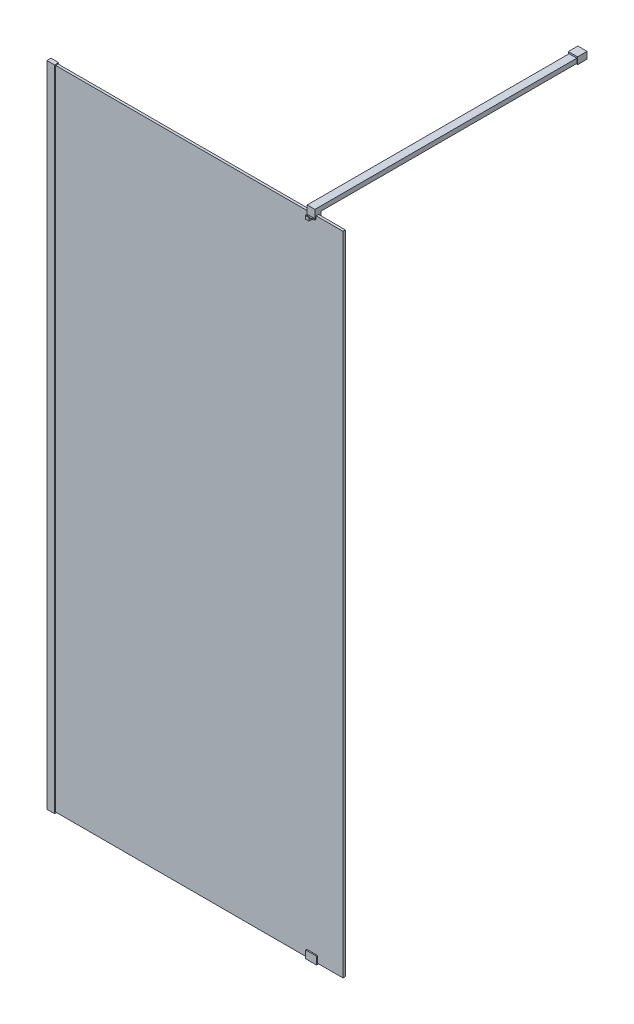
ISO-10303-21;
HEADER;
FILE_DESCRIPTION(('STEP AP214'),'2;1');
FILE_NAME('part.step','',(''),(''),'','','');
FILE_SCHEMA(('AUTOMOTIVE_DESIGN { 1 0 10303 214 1 1 1 1 }'));
ENDSEC;
DATA;
#1=APPLICATION_CONTEXT('core data for automotive mechanical design processes');
#2=APPLICATION_PROTOCOL_DEFINITION('international standard','automotive_design',2000,#1);
#3=PRODUCT_CONTEXT('',#1,'mechanical');
#4=PRODUCT('Part','Part','',(#3));
#5=PRODUCT_RELATED_PRODUCT_CATEGORY('part','',(#4));
#6=PRODUCT_DEFINITION_FORMATION('','',#4);
#7=PRODUCT_DEFINITION_CONTEXT('part definition',#1,'design');
#8=PRODUCT_DEFINITION('design','',#6,#7);
#9=PRODUCT_DEFINITION_SHAPE('','',#8);
#10=(LENGTH_UNIT() NAMED_UNIT(*) SI_UNIT(.MILLI.,.METRE.));
#11=(NAMED_UNIT(*) PLANE_ANGLE_UNIT() SI_UNIT($,.RADIAN.));
#12=(NAMED_UNIT(*) SI_UNIT($,.STERADIAN.) SOLID_ANGLE_UNIT());
#13=UNCERTAINTY_MEASURE_WITH_UNIT(LENGTH_MEASURE(1.E-05),#10,'distance_accuracy_value','');
#14=(GEOMETRIC_REPRESENTATION_CONTEXT(3) GLOBAL_UNCERTAINTY_ASSIGNED_CONTEXT((#13)) GLOBAL_UNIT_ASSIGNED_CONTEXT((#10,
#11,#12)) REPRESENTATION_CONTEXT('',''));
#15=CARTESIAN_POINT('',(0.,0.,0.));
#16=DIRECTION('',(0.,0.,1.));
#17=DIRECTION('',(1.,0.,0.));
#18=AXIS2_PLACEMENT_3D('',#15,#16,#17);
#19=CARTESIAN_POINT('',(870.95,2090.,-19.4000000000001));
#20=DIRECTION('',(-1.,0.,0.));
#21=DIRECTION('',(0.,0.,1.));
#22=AXIS2_PLACEMENT_3D('',#19,#20,#21);
#23=PLANE('',#22);
#24=DIRECTION('',(0.,-1.,0.));
#25=VECTOR('',#24,1.);
#26=CARTESIAN_POINT('',(870.95,2090.,-850.03));
#27=LINE('',#26,#25);
#28=CARTESIAN_POINT('',(870.95,2120.,-850.03));
#29=VERTEX_POINT('',#28);
#30=CARTESIAN_POINT('',(870.95,2105.,-850.03));
#31=VERTEX_POINT('',#30);
#32=EDGE_CURVE('E61',#29,#31,#27,.T.);
#33=ORIENTED_EDGE('',*,*,#32,.F.);
#34=DIRECTION('',(0.,0.,1.));
#35=VECTOR('',#34,1.);
#36=CARTESIAN_POINT('',(870.95,2120.,0.599999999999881));
#37=LINE('',#36,#35);
#38=CARTESIAN_POINT('',(870.95,2120.,0.599999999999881));
#39=VERTEX_POINT('',#38);
#40=EDGE_CURVE('E386',#29,#39,#37,.T.);
#41=ORIENTED_EDGE('',*,*,#40,.T.);
#42=DIRECTION('',(0.,-1.,0.));
#43=VECTOR('',#42,1.);
#44=CARTESIAN_POINT('',(870.95,2094.,0.599999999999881));
#45=LINE('',#44,#43);
#46=CARTESIAN_POINT('',(870.95,2094.,0.599999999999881));
#47=VERTEX_POINT('',#46);
#48=EDGE_CURVE('E388',#39,#47,#45,.T.);
#49=ORIENTED_EDGE('',*,*,#48,.T.);
#50=DIRECTION('',(0.,1.,0.));
#51=VECTOR('',#50,1.);
#52=CARTESIAN_POINT('',(870.95,2090.,0.599999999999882));
#53=LINE('',#52,#51);
#54=CARTESIAN_POINT('',(870.95,2090.,0.599999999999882));
#55=VERTEX_POINT('',#54);
#56=EDGE_CURVE('E332',#55,#47,#53,.T.);
#57=ORIENTED_EDGE('',*,*,#56,.F.);
#58=DIRECTION('',(0.,0.,-1.));
#59=VECTOR('',#58,1.);
#60=CARTESIAN_POINT('',(870.95,2090.,-3.40000000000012));
#61=LINE('',#60,#59);
#62=CARTESIAN_POINT('',(870.95,2090.,-3.40000000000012));
#63=VERTEX_POINT('',#62);
#64=EDGE_CURVE('E362',#55,#63,#61,.T.);
#65=ORIENTED_EDGE('',*,*,#64,.T.);
#66=DIRECTION('',(0.,1.,-1.30407837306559E-13));
#67=VECTOR('',#66,1.);
#68=CARTESIAN_POINT('',(870.95,2100.,-3.40000000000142));
#69=LINE('',#68,#67);
#70=CARTESIAN_POINT('',(870.95,2100.,-3.40000000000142));
#71=VERTEX_POINT('',#70);
#72=EDGE_CURVE('E392',#63,#71,#69,.T.);
#73=ORIENTED_EDGE('',*,*,#72,.T.);
#74=DIRECTION('',(0.,0.,-1.));
#75=VECTOR('',#74,1.);
#76=CARTESIAN_POINT('',(870.95,2100.,-11.4000000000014));
#77=LINE('',#76,#75);
#78=CARTESIAN_POINT('',(870.95,2100.,-11.4000000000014));
#79=VERTEX_POINT('',#78);
#80=EDGE_CURVE('E394',#71,#79,#77,.T.);
#81=ORIENTED_EDGE('',*,*,#80,.T.);
#82=DIRECTION('',(0.,-1.,1.30451205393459E-13));
#83=VECTOR('',#82,1.);
#84=CARTESIAN_POINT('',(870.95,2090.,-11.4000000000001));
#85=LINE('',#84,#83);
#86=CARTESIAN_POINT('',(870.95,2090.,-11.4000000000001));
#87=VERTEX_POINT('',#86);
#88=EDGE_CURVE('E395',#79,#87,#85,.T.);
#89=ORIENTED_EDGE('',*,*,#88,.T.);
#90=DIRECTION('',(0.,0.,-1.));
#91=VECTOR('',#90,1.);
#92=CARTESIAN_POINT('',(870.95,2090.,-19.4000000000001));
#93=LINE('',#92,#91);
#94=CARTESIAN_POINT('',(870.95,2090.,-19.4000000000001));
#95=VERTEX_POINT('',#94);
#96=EDGE_CURVE('E283',#87,#95,#93,.T.);
#97=ORIENTED_EDGE('',*,*,#96,.T.);
#98=DIRECTION('',(0.,1.,0.));
#99=VECTOR('',#98,1.);
#100=CARTESIAN_POINT('',(870.95,2120.,-19.4000000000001));
#101=LINE('',#100,#99);
#102=CARTESIAN_POINT('',(870.95,2105.,-19.4000000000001));
#103=VERTEX_POINT('',#102);
#104=EDGE_CURVE('E249',#95,#103,#101,.T.);
#105=ORIENTED_EDGE('',*,*,#104,.T.);
#106=DIRECTION('',(0.,0.,-1.));
#107=VECTOR('',#106,1.);
#108=CARTESIAN_POINT('',(870.95,2105.,-881.03));
#109=LINE('',#108,#107);
#110=EDGE_CURVE('E248',#103,#31,#109,.T.);
#111=ORIENTED_EDGE('',*,*,#110,.T.);
#112=EDGE_LOOP('',(#33,#41,#49,#57,#65,#73,#81,#89,#97,#105,#111));
#113=FACE_BOUND('',#112,.T.);
#114=ADVANCED_FACE('F46',(#113),#23,.F.);
#115=CARTESIAN_POINT('',(845.95,2090.,-19.4000000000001));
#116=DIRECTION('',(-1.,0.,0.));
#117=DIRECTION('',(0.,0.,1.));
#118=AXIS2_PLACEMENT_3D('',#115,#116,#117);
#119=PLANE('',#118);
#120=DIRECTION('',(0.,0.,1.));
#121=VECTOR('',#120,1.);
#122=CARTESIAN_POINT('',(845.95,2120.,0.599999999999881));
#123=LINE('',#122,#121);
#124=CARTESIAN_POINT('',(845.95,2120.,-850.03));
#125=VERTEX_POINT('',#124);
#126=CARTESIAN_POINT('',(845.95,2120.,0.599999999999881));
#127=VERTEX_POINT('',#126);
#128=EDGE_CURVE('E272',#125,#127,#123,.T.);
#129=ORIENTED_EDGE('',*,*,#128,.F.);
#130=DIRECTION('',(0.,-1.,0.));
#131=VECTOR('',#130,1.);
#132=CARTESIAN_POINT('',(845.95,2090.,-850.03));
#133=LINE('',#132,#131);
#134=CARTESIAN_POINT('',(845.95,2105.,-850.03));
#135=VERTEX_POINT('',#134);
#136=EDGE_CURVE('E230',#125,#135,#133,.T.);
#137=ORIENTED_EDGE('',*,*,#136,.T.);
#138=DIRECTION('',(0.,0.,1.));
#139=VECTOR('',#138,1.);
#140=CARTESIAN_POINT('',(845.95,2105.,-881.03));
#141=LINE('',#140,#139);
#142=CARTESIAN_POINT('',(845.95,2105.,-19.4000000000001));
#143=VERTEX_POINT('',#142);
#144=EDGE_CURVE('E238',#135,#143,#141,.T.);
#145=ORIENTED_EDGE('',*,*,#144,.T.);
#146=DIRECTION('',(0.,1.,0.));
#147=VECTOR('',#146,1.);
#148=CARTESIAN_POINT('',(845.95,2120.,-19.4000000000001));
#149=LINE('',#148,#147);
#150=CARTESIAN_POINT('',(845.95,2090.,-19.4000000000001));
#151=VERTEX_POINT('',#150);
#152=EDGE_CURVE('E262',#151,#143,#149,.T.);
#153=ORIENTED_EDGE('',*,*,#152,.F.);
#154=DIRECTION('',(0.,0.,-1.));
#155=VECTOR('',#154,1.);
#156=CARTESIAN_POINT('',(845.95,2090.,-19.4000000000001));
#157=LINE('',#156,#155);
#158=CARTESIAN_POINT('',(845.95,2090.,-11.4000000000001));
#159=VERTEX_POINT('',#158);
#160=EDGE_CURVE('E296',#159,#151,#157,.T.);
#161=ORIENTED_EDGE('',*,*,#160,.F.);
#162=DIRECTION('',(0.,-1.,1.30451205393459E-13));
#163=VECTOR('',#162,1.);
#164=CARTESIAN_POINT('',(845.95,2090.,-11.4000000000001));
#165=LINE('',#164,#163);
#166=CARTESIAN_POINT('',(845.95,2100.,-11.4000000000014));
#167=VERTEX_POINT('',#166);
#168=EDGE_CURVE('E294',#167,#159,#165,.T.);
#169=ORIENTED_EDGE('',*,*,#168,.F.);
#170=DIRECTION('',(0.,0.,-1.));
#171=VECTOR('',#170,1.);
#172=CARTESIAN_POINT('',(845.95,2100.,-11.4000000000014));
#173=LINE('',#172,#171);
#174=CARTESIAN_POINT('',(845.95,2100.,-3.40000000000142));
#175=VERTEX_POINT('',#174);
#176=EDGE_CURVE('E292',#175,#167,#173,.T.);
#177=ORIENTED_EDGE('',*,*,#176,.F.);
#178=DIRECTION('',(0.,1.,-1.30407837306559E-13));
#179=VECTOR('',#178,1.);
#180=CARTESIAN_POINT('',(845.95,2100.,-3.40000000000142));
#181=LINE('',#180,#179);
#182=CARTESIAN_POINT('',(845.95,2090.,-3.40000000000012));
#183=VERTEX_POINT('',#182);
#184=EDGE_CURVE('E290',#183,#175,#181,.T.);
#185=ORIENTED_EDGE('',*,*,#184,.F.);
#186=DIRECTION('',(0.,0.,-1.));
#187=VECTOR('',#186,1.);
#188=CARTESIAN_POINT('',(845.95,2090.,-3.40000000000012));
#189=LINE('',#188,#187);
#190=CARTESIAN_POINT('',(845.95,2090.,0.599999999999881));
#191=VERTEX_POINT('',#190);
#192=EDGE_CURVE('E288',#191,#183,#189,.T.);
#193=ORIENTED_EDGE('',*,*,#192,.F.);
#194=DIRECTION('',(0.,1.,0.));
#195=VECTOR('',#194,1.);
#196=CARTESIAN_POINT('',(845.95,2090.,0.599999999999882));
#197=LINE('',#196,#195);
#198=CARTESIAN_POINT('',(845.95,2094.,0.599999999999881));
#199=VERTEX_POINT('',#198);
#200=EDGE_CURVE('E329',#191,#199,#197,.T.);
#201=ORIENTED_EDGE('',*,*,#200,.T.);
#202=DIRECTION('',(0.,-1.,0.));
#203=VECTOR('',#202,1.);
#204=CARTESIAN_POINT('',(845.95,2094.,0.599999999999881));
#205=LINE('',#204,#203);
#206=EDGE_CURVE('E274',#127,#199,#205,.T.);
#207=ORIENTED_EDGE('',*,*,#206,.F.);
#208=EDGE_LOOP('',(#129,#137,#145,#153,#161,#169,#177,#185,#193,#201,#207));
#209=FACE_BOUND('',#208,.T.);
#210=ADVANCED_FACE('F259',(#209),#119,.T.);
#211=CARTESIAN_POINT('',(870.95,2120.,0.599999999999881));
#212=DIRECTION('',(0.,-1.,0.));
#213=DIRECTION('',(0.,0.,-1.));
#214=AXIS2_PLACEMENT_3D('',#211,#212,#213);
#215=PLANE('',#214);
#216=DIRECTION('',(1.,0.,0.));
#217=VECTOR('',#216,1.);
#218=CARTESIAN_POINT('',(870.95,2120.,-850.03));
#219=LINE('',#218,#217);
#220=EDGE_CURVE('E68',#125,#29,#219,.T.);
#221=ORIENTED_EDGE('',*,*,#220,.F.);
#222=ORIENTED_EDGE('',*,*,#128,.T.);
#223=DIRECTION('',(-1.,0.,0.));
#224=VECTOR('',#223,1.);
#225=CARTESIAN_POINT('',(870.95,2120.,0.599999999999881));
#226=LINE('',#225,#224);
#227=EDGE_CURVE('E326',#39,#127,#226,.T.);
#228=ORIENTED_EDGE('',*,*,#227,.F.);
#229=ORIENTED_EDGE('',*,*,#40,.F.);
#230=EDGE_LOOP('',(#221,#222,#228,#229));
#231=FACE_BOUND('',#230,.T.);
#232=ADVANCED_FACE('F437',(#231),#215,.F.);
#233=CARTESIAN_POINT('',(845.95,2105.,-19.4000000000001));
#234=DIRECTION('',(0.,1.,0.));
#235=DIRECTION('',(0.,0.,1.));
#236=AXIS2_PLACEMENT_3D('',#233,#234,#235);
#237=PLANE('',#236);
#238=DIRECTION('',(-1.,0.,0.));
#239=VECTOR('',#238,1.);
#240=CARTESIAN_POINT('',(845.95,2105.,-850.03));
#241=LINE('',#240,#239);
#242=EDGE_CURVE('E12',#31,#135,#241,.T.);
#243=ORIENTED_EDGE('',*,*,#242,.F.);
#244=ORIENTED_EDGE('',*,*,#110,.F.);
#245=DIRECTION('',(1.,0.,0.));
#246=VECTOR('',#245,1.);
#247=CARTESIAN_POINT('',(845.95,2105.,-19.4000000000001));
#248=LINE('',#247,#246);
#249=EDGE_CURVE('E244',#143,#103,#248,.T.);
#250=ORIENTED_EDGE('',*,*,#249,.F.);
#251=ORIENTED_EDGE('',*,*,#144,.F.);
#252=EDGE_LOOP('',(#243,#244,#250,#251));
#253=FACE_BOUND('',#252,.T.);
#254=ADVANCED_FACE('F265',(#253),#237,.F.);
#255=CARTESIAN_POINT('',(870.95,2094.,9.84506801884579));
#256=DIRECTION('',(0.,-1.,0.));
#257=DIRECTION('',(0.,0.,-1.));
#258=AXIS2_PLACEMENT_3D('',#255,#256,#257);
#259=PLANE('',#258);
#260=DIRECTION('',(-0.906307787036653,0.,-0.422618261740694));
#261=VECTOR('',#260,1.);
#262=CARTESIAN_POINT('',(870.025911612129,2094.,11.8267819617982));
#263=LINE('',#262,#261);
#264=CARTESIAN_POINT('',(852.45,2094.,3.6309997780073));
#265=VERTEX_POINT('',#264);
#266=EDGE_CURVE('E365',#265,#199,#263,.T.);
#267=ORIENTED_EDGE('',*,*,#266,.F.);
#268=DIRECTION('',(0.,0.,-1.));
#269=VECTOR('',#268,1.);
#270=CARTESIAN_POINT('',(852.45,2094.,9.84506801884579));
#271=LINE('',#270,#269);
#272=CARTESIAN_POINT('',(852.45,2094.,9.84506801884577));
#273=VERTEX_POINT('',#272);
#274=EDGE_CURVE('E273',#273,#265,#271,.T.);
#275=ORIENTED_EDGE('',*,*,#274,.F.);
#276=DIRECTION('',(-1.,0.,0.));
#277=VECTOR('',#276,1.);
#278=CARTESIAN_POINT('',(870.95,2094.,9.84506801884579));
#279=LINE('',#278,#277);
#280=CARTESIAN_POINT('',(864.45,2094.,9.84506801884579));
#281=VERTEX_POINT('',#280);
#282=EDGE_CURVE('E320',#281,#273,#279,.T.);
#283=ORIENTED_EDGE('',*,*,#282,.F.);
#284=DIRECTION('',(0.,0.,1.));
#285=VECTOR('',#284,1.);
#286=CARTESIAN_POINT('',(864.45,2094.,9.84506801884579));
#287=LINE('',#286,#285);
#288=CARTESIAN_POINT('',(864.45,2094.,3.63099977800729));
#289=VERTEX_POINT('',#288);
#290=EDGE_CURVE('E379',#289,#281,#287,.T.);
#291=ORIENTED_EDGE('',*,*,#290,.F.);
#292=DIRECTION('',(-0.906307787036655,0.,0.422618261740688));
#293=VECTOR('',#292,1.);
#294=CARTESIAN_POINT('',(867.408933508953,2094.,2.25122642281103));
#295=LINE('',#294,#293);
#296=EDGE_CURVE('E364',#47,#289,#295,.T.);
#297=ORIENTED_EDGE('',*,*,#296,.F.);
#298=DIRECTION('',(-1.,0.,0.));
#299=VECTOR('',#298,1.);
#300=CARTESIAN_POINT('',(870.95,2094.,0.599999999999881));
#301=LINE('',#300,#299);
#302=EDGE_CURVE('E323',#47,#199,#301,.T.);
#303=ORIENTED_EDGE('',*,*,#302,.T.);
#304=EDGE_LOOP('',(#267,#275,#283,#291,#297,#303));
#305=FACE_BOUND('',#304,.T.);
#306=ADVANCED_FACE('F424',(#305),#259,.F.);
#307=CARTESIAN_POINT('',(870.95,2100.,10.3700000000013));
#308=DIRECTION('',(0.,-0.087155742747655,0.996194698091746));
#309=DIRECTION('',(0.,-0.996194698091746,-0.087155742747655));
#310=AXIS2_PLACEMENT_3D('',#307,#308,#309);
#311=PLANE('',#310);
#312=DIRECTION('',(0.,-0.996194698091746,-0.087155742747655));
#313=VECTOR('',#312,1.);
#314=CARTESIAN_POINT('',(852.45,2100.,10.3700000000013));
#315=LINE('',#314,#313);
#316=CARTESIAN_POINT('',(852.45,2100.,10.3700000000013));
#317=VERTEX_POINT('',#316);
#318=EDGE_CURVE('E276',#317,#273,#315,.T.);
#319=ORIENTED_EDGE('',*,*,#318,.F.);
#320=DIRECTION('',(-1.,0.,0.));
#321=VECTOR('',#320,1.);
#322=CARTESIAN_POINT('',(870.95,2100.,10.3700000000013));
#323=LINE('',#322,#321);
#324=CARTESIAN_POINT('',(864.45,2100.,10.3700000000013));
#325=VERTEX_POINT('',#324);
#326=EDGE_CURVE('E317',#325,#317,#323,.T.);
#327=ORIENTED_EDGE('',*,*,#326,.F.);
#328=DIRECTION('',(0.,0.996194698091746,0.087155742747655));
#329=VECTOR('',#328,1.);
#330=CARTESIAN_POINT('',(864.45,2100.,10.3700000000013));
#331=LINE('',#330,#329);
#332=EDGE_CURVE('E376',#281,#325,#331,.T.);
#333=ORIENTED_EDGE('',*,*,#332,.F.);
#334=ORIENTED_EDGE('',*,*,#282,.T.);
#335=EDGE_LOOP('',(#319,#327,#333,#334));
#336=FACE_BOUND('',#335,.T.);
#337=ADVANCED_FACE('F428',(#336),#311,.F.);
#338=CARTESIAN_POINT('',(870.95,2100.,13.3700000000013));
#339=DIRECTION('',(0.,-1.,1.48029736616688E-13));
#340=DIRECTION('',(0.,-1.48029736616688E-13,-1.));
#341=AXIS2_PLACEMENT_3D('',#338,#339,#340);
#342=PLANE('',#341);
#343=DIRECTION('',(0.,-1.48029736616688E-13,-1.));
#344=VECTOR('',#343,1.);
#345=CARTESIAN_POINT('',(852.45,2100.,13.3700000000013));
#346=LINE('',#345,#344);
#347=CARTESIAN_POINT('',(852.45,2100.,13.3700000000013));
#348=VERTEX_POINT('',#347);
#349=EDGE_CURVE('E382',#348,#317,#346,.T.);
#350=ORIENTED_EDGE('',*,*,#349,.F.);
#351=DIRECTION('',(-1.,0.,0.));
#352=VECTOR('',#351,1.);
#353=CARTESIAN_POINT('',(870.95,2100.,13.3700000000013));
#354=LINE('',#353,#352);
#355=CARTESIAN_POINT('',(864.45,2100.,13.3700000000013));
#356=VERTEX_POINT('',#355);
#357=EDGE_CURVE('E314',#356,#348,#354,.T.);
#358=ORIENTED_EDGE('',*,*,#357,.F.);
#359=DIRECTION('',(0.,1.48029736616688E-13,1.));
#360=VECTOR('',#359,1.);
#361=CARTESIAN_POINT('',(864.45,2100.,13.3700000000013));
#362=LINE('',#361,#360);
#363=EDGE_CURVE('E368',#325,#356,#362,.T.);
#364=ORIENTED_EDGE('',*,*,#363,.F.);
#365=ORIENTED_EDGE('',*,*,#326,.T.);
#366=EDGE_LOOP('',(#350,#358,#364,#365));
#367=FACE_BOUND('',#366,.T.);
#368=ADVANCED_FACE('F431',(#367),#342,.F.);
#369=CARTESIAN_POINT('',(870.95,2090.,13.3700000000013));
#370=DIRECTION('',(0.,0.,-1.));
#371=DIRECTION('',(0.,1.,0.));
#372=AXIS2_PLACEMENT_3D('',#369,#370,#371);
#373=PLANE('',#372);
#374=ORIENTED_EDGE('',*,*,#357,.T.);
#375=DIRECTION('',(0.,-1.,0.));
#376=VECTOR('',#375,1.);
#377=CARTESIAN_POINT('',(852.45,7640.69449514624,13.3700000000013));
#378=LINE('',#377,#376);
#379=CARTESIAN_POINT('',(852.45,2090.,13.3700000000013));
#380=VERTEX_POINT('',#379);
#381=EDGE_CURVE('E345',#348,#380,#378,.T.);
#382=ORIENTED_EDGE('',*,*,#381,.T.);
#383=DIRECTION('',(-1.,0.,0.));
#384=VECTOR('',#383,1.);
#385=CARTESIAN_POINT('',(870.95,2090.,13.3700000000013));
#386=LINE('',#385,#384);
#387=CARTESIAN_POINT('',(864.45,2090.,13.3700000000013));
#388=VERTEX_POINT('',#387);
#389=EDGE_CURVE('E311',#388,#380,#386,.T.);
#390=ORIENTED_EDGE('',*,*,#389,.F.);
#391=DIRECTION('',(0.,-1.,0.));
#392=VECTOR('',#391,1.);
#393=CARTESIAN_POINT('',(864.45,7640.69449514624,13.3700000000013));
#394=LINE('',#393,#392);
#395=EDGE_CURVE('E355',#356,#388,#394,.T.);
#396=ORIENTED_EDGE('',*,*,#395,.F.);
#397=EDGE_LOOP('',(#374,#382,#390,#396));
#398=FACE_BOUND('',#397,.T.);
#399=ADVANCED_FACE('F353',(#398),#373,.F.);
#400=CARTESIAN_POINT('',(870.95,2090.,-3.40000000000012));
#401=DIRECTION('',(0.,1.,0.));
#402=DIRECTION('',(0.,0.,1.));
#403=AXIS2_PLACEMENT_3D('',#400,#401,#402);
#404=PLANE('',#403);
#405=DIRECTION('',(0.906307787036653,0.,0.422618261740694));
#406=VECTOR('',#405,1.);
#407=CARTESIAN_POINT('',(864.952756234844,2090.,9.46113075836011));
#408=LINE('',#407,#406);
#409=CARTESIAN_POINT('',(852.45,2090.,3.6309997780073));
#410=VERTEX_POINT('',#409);
#411=EDGE_CURVE('E370',#191,#410,#408,.T.);
#412=ORIENTED_EDGE('',*,*,#411,.F.);
#413=ORIENTED_EDGE('',*,*,#192,.T.);
#414=DIRECTION('',(-1.,0.,0.));
#415=VECTOR('',#414,1.);
#416=CARTESIAN_POINT('',(870.95,2090.,-3.40000000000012));
#417=LINE('',#416,#415);
#418=EDGE_CURVE('E308',#63,#183,#417,.T.);
#419=ORIENTED_EDGE('',*,*,#418,.F.);
#420=ORIENTED_EDGE('',*,*,#64,.F.);
#421=DIRECTION('',(0.906307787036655,0.,-0.422618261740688));
#422=VECTOR('',#421,1.);
#423=CARTESIAN_POINT('',(872.482088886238,2090.,-0.114424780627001));
#424=LINE('',#423,#422);
#425=CARTESIAN_POINT('',(864.45,2090.,3.6309997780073));
#426=VERTEX_POINT('',#425);
#427=EDGE_CURVE('E360',#426,#55,#424,.T.);
#428=ORIENTED_EDGE('',*,*,#427,.F.);
#429=DIRECTION('',(0.,0.,-1.));
#430=VECTOR('',#429,1.);
#431=CARTESIAN_POINT('',(864.45,2090.,-3.40000000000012));
#432=LINE('',#431,#430);
#433=EDGE_CURVE('E334',#388,#426,#432,.T.);
#434=ORIENTED_EDGE('',*,*,#433,.F.);
#435=ORIENTED_EDGE('',*,*,#389,.T.);
#436=DIRECTION('',(0.,0.,1.));
#437=VECTOR('',#436,1.);
#438=CARTESIAN_POINT('',(852.45,2090.,-3.40000000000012));
#439=LINE('',#438,#437);
#440=EDGE_CURVE('E54',#410,#380,#439,.T.);
#441=ORIENTED_EDGE('',*,*,#440,.F.);
#442=EDGE_LOOP('',(#412,#413,#419,#420,#428,#434,#435,#441));
#443=FACE_BOUND('',#442,.T.);
#444=ADVANCED_FACE('F357',(#443),#404,.F.);
#445=CARTESIAN_POINT('',(870.95,2120.,-19.4000000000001));
#446=DIRECTION('',(0.,0.,1.));
#447=DIRECTION('',(0.,-1.,0.));
#448=AXIS2_PLACEMENT_3D('',#445,#446,#447);
#449=PLANE('',#448);
#450=ORIENTED_EDGE('',*,*,#152,.T.);
#451=ORIENTED_EDGE('',*,*,#249,.T.);
#452=ORIENTED_EDGE('',*,*,#104,.F.);
#453=DIRECTION('',(-1.,0.,0.));
#454=VECTOR('',#453,1.);
#455=CARTESIAN_POINT('',(870.95,2090.,-19.4000000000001));
#456=LINE('',#455,#454);
#457=EDGE_CURVE('E271',#95,#151,#456,.T.);
#458=ORIENTED_EDGE('',*,*,#457,.T.);
#459=EDGE_LOOP('',(#450,#451,#452,#458));
#460=FACE_BOUND('',#459,.T.);
#461=ADVANCED_FACE('F48',(#460),#449,.F.);
#462=CARTESIAN_POINT('',(870.95,2094.,0.599999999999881));
#463=DIRECTION('',(0.,0.,-1.));
#464=DIRECTION('',(0.,1.,0.));
#465=AXIS2_PLACEMENT_3D('',#462,#463,#464);
#466=PLANE('',#465);
#467=ORIENTED_EDGE('',*,*,#206,.T.);
#468=ORIENTED_EDGE('',*,*,#302,.F.);
#469=ORIENTED_EDGE('',*,*,#48,.F.);
#470=ORIENTED_EDGE('',*,*,#227,.T.);
#471=EDGE_LOOP('',(#467,#468,#469,#470));
#472=FACE_BOUND('',#471,.T.);
#473=ADVANCED_FACE('F435',(#472),#466,.F.);
#474=CARTESIAN_POINT('',(870.95,2100.,-3.40000000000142));
#475=DIRECTION('',(0.,1.30407837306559E-13,1.));
#476=DIRECTION('',(0.,-1.,1.30407837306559E-13));
#477=AXIS2_PLACEMENT_3D('',#474,#475,#476);
#478=PLANE('',#477);
#479=ORIENTED_EDGE('',*,*,#184,.T.);
#480=DIRECTION('',(-1.,0.,0.));
#481=VECTOR('',#480,1.);
#482=CARTESIAN_POINT('',(870.95,2100.,-3.40000000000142));
#483=LINE('',#482,#481);
#484=EDGE_CURVE('E305',#71,#175,#483,.T.);
#485=ORIENTED_EDGE('',*,*,#484,.F.);
#486=ORIENTED_EDGE('',*,*,#72,.F.);
#487=ORIENTED_EDGE('',*,*,#418,.T.);
#488=EDGE_LOOP('',(#479,#485,#486,#487));
#489=FACE_BOUND('',#488,.T.);
#490=ADVANCED_FACE('F413',(#489),#478,.F.);
#491=CARTESIAN_POINT('',(870.95,2100.,-11.4000000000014));
#492=DIRECTION('',(0.,1.,0.));
#493=DIRECTION('',(0.,0.,1.));
#494=AXIS2_PLACEMENT_3D('',#491,#492,#493);
#495=PLANE('',#494);
#496=ORIENTED_EDGE('',*,*,#176,.T.);
#497=DIRECTION('',(-1.,0.,0.));
#498=VECTOR('',#497,1.);
#499=CARTESIAN_POINT('',(870.95,2100.,-11.4000000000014));
#500=LINE('',#499,#498);
#501=EDGE_CURVE('E302',#79,#167,#500,.T.);
#502=ORIENTED_EDGE('',*,*,#501,.F.);
#503=ORIENTED_EDGE('',*,*,#80,.F.);
#504=ORIENTED_EDGE('',*,*,#484,.T.);
#505=EDGE_LOOP('',(#496,#502,#503,#504));
#506=FACE_BOUND('',#505,.T.);
#507=ADVANCED_FACE('F409',(#506),#495,.F.);
#508=CARTESIAN_POINT('',(870.95,2090.,-11.4000000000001));
#509=DIRECTION('',(0.,-1.30451205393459E-13,-1.));
#510=DIRECTION('',(0.,1.,-1.30451205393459E-13));
#511=AXIS2_PLACEMENT_3D('',#508,#509,#510);
#512=PLANE('',#511);
#513=ORIENTED_EDGE('',*,*,#168,.T.);
#514=DIRECTION('',(-1.,0.,0.));
#515=VECTOR('',#514,1.);
#516=CARTESIAN_POINT('',(870.95,2090.,-11.4000000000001));
#517=LINE('',#516,#515);
#518=EDGE_CURVE('E299',#87,#159,#517,.T.);
#519=ORIENTED_EDGE('',*,*,#518,.F.);
#520=ORIENTED_EDGE('',*,*,#88,.F.);
#521=ORIENTED_EDGE('',*,*,#501,.T.);
#522=EDGE_LOOP('',(#513,#519,#520,#521));
#523=FACE_BOUND('',#522,.T.);
#524=ADVANCED_FACE('F405',(#523),#512,.F.);
#525=CARTESIAN_POINT('',(870.95,2090.,-19.4000000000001));
#526=DIRECTION('',(0.,1.,0.));
#527=DIRECTION('',(0.,0.,1.));
#528=AXIS2_PLACEMENT_3D('',#525,#526,#527);
#529=PLANE('',#528);
#530=ORIENTED_EDGE('',*,*,#160,.T.);
#531=ORIENTED_EDGE('',*,*,#457,.F.);
#532=ORIENTED_EDGE('',*,*,#96,.F.);
#533=ORIENTED_EDGE('',*,*,#518,.T.);
#534=EDGE_LOOP('',(#530,#531,#532,#533));
#535=FACE_BOUND('',#534,.T.);
#536=ADVANCED_FACE('F400',(#535),#529,.F.);
#537=CARTESIAN_POINT('',(845.95,7640.69449514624,0.599999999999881));
#538=DIRECTION('',(-0.422618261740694,0.,0.906307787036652));
#539=DIRECTION('',(0.906307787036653,0.,0.422618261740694));
#540=AXIS2_PLACEMENT_3D('',#537,#538,#539);
#541=PLANE('',#540);
#542=DIRECTION('',(0.,-1.,0.));
#543=VECTOR('',#542,1.);
#544=CARTESIAN_POINT('',(852.45,7640.69449514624,3.6309997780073));
#545=LINE('',#544,#543);
#546=EDGE_CURVE('E348',#265,#410,#545,.T.);
#547=ORIENTED_EDGE('',*,*,#546,.F.);
#548=ORIENTED_EDGE('',*,*,#266,.T.);
#549=ORIENTED_EDGE('',*,*,#200,.F.);
#550=ORIENTED_EDGE('',*,*,#411,.T.);
#551=EDGE_LOOP('',(#547,#548,#549,#550));
#552=FACE_BOUND('',#551,.T.);
#553=ADVANCED_FACE('F432',(#552),#541,.T.);
#554=CARTESIAN_POINT('',(852.45,7640.69449514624,3.6309997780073));
#555=DIRECTION('',(-1.,0.,0.));
#556=DIRECTION('',(0.,0.,1.));
#557=AXIS2_PLACEMENT_3D('',#554,#555,#556);
#558=PLANE('',#557);
#559=ORIENTED_EDGE('',*,*,#318,.T.);
#560=ORIENTED_EDGE('',*,*,#274,.T.);
#561=ORIENTED_EDGE('',*,*,#546,.T.);
#562=ORIENTED_EDGE('',*,*,#440,.T.);
#563=ORIENTED_EDGE('',*,*,#381,.F.);
#564=ORIENTED_EDGE('',*,*,#349,.T.);
#565=EDGE_LOOP('',(#559,#560,#561,#562,#563,#564));
#566=FACE_BOUND('',#565,.T.);
#567=ADVANCED_FACE('F344',(#566),#558,.T.);
#568=CARTESIAN_POINT('',(864.45,7640.69449514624,3.6309997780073));
#569=DIRECTION('',(1.,0.,0.));
#570=DIRECTION('',(0.,0.,-1.));
#571=AXIS2_PLACEMENT_3D('',#568,#569,#570);
#572=PLANE('',#571);
#573=DIRECTION('',(0.,-1.,0.));
#574=VECTOR('',#573,1.);
#575=CARTESIAN_POINT('',(864.45,7640.69449514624,3.6309997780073));
#576=LINE('',#575,#574);
#577=EDGE_CURVE('E241',#289,#426,#576,.T.);
#578=ORIENTED_EDGE('',*,*,#577,.F.);
#579=ORIENTED_EDGE('',*,*,#290,.T.);
#580=ORIENTED_EDGE('',*,*,#332,.T.);
#581=ORIENTED_EDGE('',*,*,#363,.T.);
#582=ORIENTED_EDGE('',*,*,#395,.T.);
#583=ORIENTED_EDGE('',*,*,#433,.T.);
#584=EDGE_LOOP('',(#578,#579,#580,#581,#582,#583));
#585=FACE_BOUND('',#584,.T.);
#586=ADVANCED_FACE('F420',(#585),#572,.T.);
#587=CARTESIAN_POINT('',(870.95,7640.69449514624,0.599999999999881));
#588=DIRECTION('',(0.422618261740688,0.,0.906307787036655));
#589=DIRECTION('',(0.906307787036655,0.,-0.422618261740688));
#590=AXIS2_PLACEMENT_3D('',#587,#588,#589);
#591=PLANE('',#590);
#592=ORIENTED_EDGE('',*,*,#56,.T.);
#593=ORIENTED_EDGE('',*,*,#296,.T.);
#594=ORIENTED_EDGE('',*,*,#577,.T.);
#595=ORIENTED_EDGE('',*,*,#427,.T.);
#596=EDGE_LOOP('',(#592,#593,#594,#595));
#597=FACE_BOUND('',#596,.T.);
#598=ADVANCED_FACE('F418',(#597),#591,.T.);
#599=CARTESIAN_POINT('',(843.449999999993,2103.,-850.03));
#600=DIRECTION('',(0.,0.,-1.));
#601=DIRECTION('',(-1.,0.,0.));
#602=AXIS2_PLACEMENT_3D('',#599,#600,#601);
#603=PLANE('',#602);
#604=DIRECTION('',(0.,1.,0.));
#605=VECTOR('',#604,1.);
#606=CARTESIAN_POINT('',(843.449999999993,2125.,-850.03));
#607=LINE('',#606,#605);
#608=CARTESIAN_POINT('',(843.449999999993,2103.,-850.03));
#609=VERTEX_POINT('',#608);
#610=CARTESIAN_POINT('',(843.449999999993,2125.,-850.03));
#611=VERTEX_POINT('',#610);
#612=EDGE_CURVE('E209',#609,#611,#607,.T.);
#613=ORIENTED_EDGE('',*,*,#612,.F.);
#614=DIRECTION('',(-1.,0.,0.));
#615=VECTOR('',#614,1.);
#616=CARTESIAN_POINT('',(873.449999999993,2103.,-850.03));
#617=LINE('',#616,#615);
#618=CARTESIAN_POINT('',(873.449999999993,2103.,-850.03));
#619=VERTEX_POINT('',#618);
#620=EDGE_CURVE('E201',#619,#609,#617,.T.);
#621=ORIENTED_EDGE('',*,*,#620,.F.);
#622=DIRECTION('',(0.,-1.,0.));
#623=VECTOR('',#622,1.);
#624=CARTESIAN_POINT('',(873.449999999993,2125.,-850.03));
#625=LINE('',#624,#623);
#626=CARTESIAN_POINT('',(873.449999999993,2125.,-850.03));
#627=VERTEX_POINT('',#626);
#628=EDGE_CURVE('E212',#627,#619,#625,.T.);
#629=ORIENTED_EDGE('',*,*,#628,.F.);
#630=DIRECTION('',(1.,0.,0.));
#631=VECTOR('',#630,1.);
#632=CARTESIAN_POINT('',(873.449999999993,2125.,-850.03));
#633=LINE('',#632,#631);
#634=EDGE_CURVE('E193',#611,#627,#633,.T.);
#635=ORIENTED_EDGE('',*,*,#634,.F.);
#636=EDGE_LOOP('',(#613,#621,#629,#635));
#637=FACE_BOUND('',#636,.T.);
#638=ORIENTED_EDGE('',*,*,#136,.F.);
#639=ORIENTED_EDGE('',*,*,#220,.T.);
#640=ORIENTED_EDGE('',*,*,#32,.T.);
#641=ORIENTED_EDGE('',*,*,#242,.T.);
#642=EDGE_LOOP('',(#638,#639,#640,#641));
#643=FACE_BOUND('',#642,.T.);
#644=ADVANCED_FACE('F206',(#637,#643),#603,.F.);
#645=CARTESIAN_POINT('',(843.449999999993,2125.,-850.03));
#646=DIRECTION('',(-1.,0.,0.));
#647=DIRECTION('',(0.,-1.,0.));
#648=AXIS2_PLACEMENT_3D('',#645,#646,#647);
#649=PLANE('',#648);
#650=DIRECTION('',(0.,1.,0.));
#651=VECTOR('',#650,1.);
#652=CARTESIAN_POINT('',(843.449999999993,2125.,-881.03));
#653=LINE('',#652,#651);
#654=CARTESIAN_POINT('',(843.449999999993,2103.,-881.03));
#655=VERTEX_POINT('',#654);
#656=CARTESIAN_POINT('',(843.449999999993,2125.,-881.03));
#657=VERTEX_POINT('',#656);
#658=EDGE_CURVE('E224',#655,#657,#653,.T.);
#659=ORIENTED_EDGE('',*,*,#658,.F.);
#660=DIRECTION('',(0.,0.,-1.));
#661=VECTOR('',#660,1.);
#662=CARTESIAN_POINT('',(843.449999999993,2103.,-850.03));
#663=LINE('',#662,#661);
#664=EDGE_CURVE('E215',#609,#655,#663,.T.);
#665=ORIENTED_EDGE('',*,*,#664,.F.);
#666=ORIENTED_EDGE('',*,*,#612,.T.);
#667=DIRECTION('',(0.,0.,-1.));
#668=VECTOR('',#667,1.);
#669=CARTESIAN_POINT('',(843.449999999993,2125.,-850.03));
#670=LINE('',#669,#668);
#671=EDGE_CURVE('E190',#611,#657,#670,.T.);
#672=ORIENTED_EDGE('',*,*,#671,.T.);
#673=EDGE_LOOP('',(#659,#665,#666,#672));
#674=FACE_BOUND('',#673,.T.);
#675=ADVANCED_FACE('F214',(#674),#649,.T.);
#676=CARTESIAN_POINT('',(873.449999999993,2103.,-850.03));
#677=DIRECTION('',(0.,-1.,0.));
#678=DIRECTION('',(0.,0.,-1.));
#679=AXIS2_PLACEMENT_3D('',#676,#677,#678);
#680=PLANE('',#679);
#681=DIRECTION('',(-1.,0.,0.));
#682=VECTOR('',#681,1.);
#683=CARTESIAN_POINT('',(873.449999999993,2103.,-881.03));
#684=LINE('',#683,#682);
#685=CARTESIAN_POINT('',(873.449999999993,2103.,-881.03));
#686=VERTEX_POINT('',#685);
#687=EDGE_CURVE('E216',#686,#655,#684,.T.);
#688=ORIENTED_EDGE('',*,*,#687,.F.);
#689=DIRECTION('',(0.,0.,-1.));
#690=VECTOR('',#689,1.);
#691=CARTESIAN_POINT('',(873.449999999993,2103.,-850.03));
#692=LINE('',#691,#690);
#693=EDGE_CURVE('E231',#619,#686,#692,.T.);
#694=ORIENTED_EDGE('',*,*,#693,.F.);
#695=ORIENTED_EDGE('',*,*,#620,.T.);
#696=ORIENTED_EDGE('',*,*,#664,.T.);
#697=EDGE_LOOP('',(#688,#694,#695,#696));
#698=FACE_BOUND('',#697,.T.);
#699=ADVANCED_FACE('F444',(#698),#680,.T.);
#700=CARTESIAN_POINT('',(873.449999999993,2125.,-850.03));
#701=DIRECTION('',(1.,0.,0.));
#702=DIRECTION('',(0.,0.,-1.));
#703=AXIS2_PLACEMENT_3D('',#700,#701,#702);
#704=PLANE('',#703);
#705=DIRECTION('',(0.,-1.,0.));
#706=VECTOR('',#705,1.);
#707=CARTESIAN_POINT('',(873.449999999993,2125.,-881.03));
#708=LINE('',#707,#706);
#709=CARTESIAN_POINT('',(873.449999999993,2125.,-881.03));
#710=VERTEX_POINT('',#709);
#711=EDGE_CURVE('E219',#710,#686,#708,.T.);
#712=ORIENTED_EDGE('',*,*,#711,.F.);
#713=DIRECTION('',(0.,0.,-1.));
#714=VECTOR('',#713,1.);
#715=CARTESIAN_POINT('',(873.449999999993,2125.,-850.03));
#716=LINE('',#715,#714);
#717=EDGE_CURVE('E200',#627,#710,#716,.T.);
#718=ORIENTED_EDGE('',*,*,#717,.F.);
#719=ORIENTED_EDGE('',*,*,#628,.T.);
#720=ORIENTED_EDGE('',*,*,#693,.T.);
#721=EDGE_LOOP('',(#712,#718,#719,#720));
#722=FACE_BOUND('',#721,.T.);
#723=ADVANCED_FACE('F612',(#722),#704,.T.);
#724=CARTESIAN_POINT('',(873.449999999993,2125.,-850.03));
#725=DIRECTION('',(0.,1.,0.));
#726=DIRECTION('',(0.,0.,1.));
#727=AXIS2_PLACEMENT_3D('',#724,#725,#726);
#728=PLANE('',#727);
#729=DIRECTION('',(1.,0.,0.));
#730=VECTOR('',#729,1.);
#731=CARTESIAN_POINT('',(873.449999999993,2125.,-881.03));
#732=LINE('',#731,#730);
#733=EDGE_CURVE('E195',#657,#710,#732,.T.);
#734=ORIENTED_EDGE('',*,*,#733,.F.);
#735=ORIENTED_EDGE('',*,*,#671,.F.);
#736=ORIENTED_EDGE('',*,*,#634,.T.);
#737=ORIENTED_EDGE('',*,*,#717,.T.);
#738=EDGE_LOOP('',(#734,#735,#736,#737));
#739=FACE_BOUND('',#738,.T.);
#740=ADVANCED_FACE('F192',(#739),#728,.T.);
#741=CARTESIAN_POINT('',(845.95,2105.,-881.03));
#742=DIRECTION('',(0.,0.,-1.));
#743=DIRECTION('',(-1.,0.,0.));
#744=AXIS2_PLACEMENT_3D('',#741,#742,#743);
#745=PLANE('',#744);
#746=ORIENTED_EDGE('',*,*,#658,.T.);
#747=ORIENTED_EDGE('',*,*,#733,.T.);
#748=ORIENTED_EDGE('',*,*,#711,.T.);
#749=ORIENTED_EDGE('',*,*,#687,.T.);
#750=EDGE_LOOP('',(#746,#747,#748,#749));
#751=FACE_BOUND('',#750,.T.);
#752=ADVANCED_FACE('F485',(#751),#745,.T.);
#753=CLOSED_SHELL('',(#114,#210,#232,#254,#306,#337,#368,#399,#444,#461,#473,#490,#507,#524,
#536,#553,#567,#586,#598,#644,#675,#699,#723,#740,#752));
#754=MANIFOLD_SOLID_BREP('B2',#753);
#755=CARTESIAN_POINT('',(875.95,22.,-11.4000000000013));
#756=DIRECTION('',(0.,0.,-1.));
#757=DIRECTION('',(0.,1.,0.));
#758=AXIS2_PLACEMENT_3D('',#755,#756,#757);
#759=PLANE('',#758);
#760=DIRECTION('',(0.,-1.,0.));
#761=VECTOR('',#760,1.);
#762=CARTESIAN_POINT('',(840.95,22.,-11.4000000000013));
#763=LINE('',#762,#761);
#764=CARTESIAN_POINT('',(840.95,22.,-11.4000000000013));
#765=VERTEX_POINT('',#764);
#766=CARTESIAN_POINT('',(840.95,0.,-11.4));
#767=VERTEX_POINT('',#766);
#768=EDGE_CURVE('E765',#765,#767,#763,.T.);
#769=ORIENTED_EDGE('',*,*,#768,.T.);
#770=DIRECTION('',(-1.,0.,0.));
#771=VECTOR('',#770,1.);
#772=CARTESIAN_POINT('',(875.95,0.,-11.4));
#773=LINE('',#772,#771);
#774=CARTESIAN_POINT('',(875.95,0.,-11.4));
#775=VERTEX_POINT('',#774);
#776=EDGE_CURVE('E44',#775,#767,#773,.T.);
#777=ORIENTED_EDGE('',*,*,#776,.F.);
#778=DIRECTION('',(0.,-1.,0.));
#779=VECTOR('',#778,1.);
#780=CARTESIAN_POINT('',(875.95,22.,-11.4000000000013));
#781=LINE('',#780,#779);
#782=CARTESIAN_POINT('',(875.95,22.,-11.4000000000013));
#783=VERTEX_POINT('',#782);
#784=EDGE_CURVE('E779',#783,#775,#781,.T.);
#785=ORIENTED_EDGE('',*,*,#784,.F.);
#786=DIRECTION('',(-1.,0.,0.));
#787=VECTOR('',#786,1.);
#788=CARTESIAN_POINT('',(875.95,22.,-11.4000000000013));
#789=LINE('',#788,#787);
#790=EDGE_CURVE('E761',#783,#765,#789,.T.);
#791=ORIENTED_EDGE('',*,*,#790,.T.);
#792=EDGE_LOOP('',(#769,#777,#785,#791));
#793=FACE_BOUND('',#792,.T.);
#794=ADVANCED_FACE('F669',(#793),#759,.F.);
#795=CARTESIAN_POINT('',(875.95,0.,-11.4));
#796=DIRECTION('',(0.,-1.,0.));
#797=DIRECTION('',(0.,0.,-1.));
#798=AXIS2_PLACEMENT_3D('',#795,#796,#797);
#799=PLANE('',#798);
#800=DIRECTION('',(0.,0.,1.));
#801=VECTOR('',#800,1.);
#802=CARTESIAN_POINT('',(840.95,0.,-11.4));
#803=LINE('',#802,#801);
#804=CARTESIAN_POINT('',(840.95,0.,-3.4));
#805=VERTEX_POINT('',#804);
#806=EDGE_CURVE('E768',#767,#805,#803,.T.);
#807=ORIENTED_EDGE('',*,*,#806,.T.);
#808=DIRECTION('',(-1.,0.,0.));
#809=VECTOR('',#808,1.);
#810=CARTESIAN_POINT('',(875.95,0.,-3.4));
#811=LINE('',#810,#809);
#812=CARTESIAN_POINT('',(875.95,0.,-3.4));
#813=VERTEX_POINT('',#812);
#814=EDGE_CURVE('E677',#813,#805,#811,.T.);
#815=ORIENTED_EDGE('',*,*,#814,.F.);
#816=DIRECTION('',(0.,0.,1.));
#817=VECTOR('',#816,1.);
#818=CARTESIAN_POINT('',(875.95,0.,-11.4));
#819=LINE('',#818,#817);
#820=EDGE_CURVE('E728',#775,#813,#819,.T.);
#821=ORIENTED_EDGE('',*,*,#820,.F.);
#822=ORIENTED_EDGE('',*,*,#776,.T.);
#823=EDGE_LOOP('',(#807,#815,#821,#822));
#824=FACE_BOUND('',#823,.T.);
#825=ADVANCED_FACE('F814',(#824),#799,.F.);
#826=CARTESIAN_POINT('',(875.95,0.,-3.4));
#827=DIRECTION('',(0.,0.,1.));
#828=DIRECTION('',(0.,-1.,0.));
#829=AXIS2_PLACEMENT_3D('',#826,#827,#828);
#830=PLANE('',#829);
#831=DIRECTION('',(0.,1.,0.));
#832=VECTOR('',#831,1.);
#833=CARTESIAN_POINT('',(840.95,0.,-3.4));
#834=LINE('',#833,#832);
#835=CARTESIAN_POINT('',(840.95,21.9999999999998,-3.4000000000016));
#836=VERTEX_POINT('',#835);
#837=EDGE_CURVE('E770',#805,#836,#834,.T.);
#838=ORIENTED_EDGE('',*,*,#837,.T.);
#839=DIRECTION('',(-1.,0.,0.));
#840=VECTOR('',#839,1.);
#841=CARTESIAN_POINT('',(875.95,21.9999999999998,-3.4000000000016));
#842=LINE('',#841,#840);
#843=CARTESIAN_POINT('',(875.95,21.9999999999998,-3.4000000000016));
#844=VERTEX_POINT('',#843);
#845=EDGE_CURVE('E786',#844,#836,#842,.T.);
#846=ORIENTED_EDGE('',*,*,#845,.F.);
#847=DIRECTION('',(0.,1.,0.));
#848=VECTOR('',#847,1.);
#849=CARTESIAN_POINT('',(875.95,0.,-3.4));
#850=LINE('',#849,#848);
#851=EDGE_CURVE('E794',#813,#844,#850,.T.);
#852=ORIENTED_EDGE('',*,*,#851,.F.);
#853=ORIENTED_EDGE('',*,*,#814,.T.);
#854=EDGE_LOOP('',(#838,#846,#852,#853));
#855=FACE_BOUND('',#854,.T.);
#856=ADVANCED_FACE('F792',(#855),#830,.F.);
#857=CARTESIAN_POINT('',(875.95,22.,0.349999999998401));
#858=DIRECTION('',(0.,-1.,0.));
#859=DIRECTION('',(0.,0.,-1.));
#860=AXIS2_PLACEMENT_3D('',#857,#858,#859);
#861=PLANE('',#860);
#862=DIRECTION('',(0.,0.,1.));
#863=VECTOR('',#862,1.);
#864=CARTESIAN_POINT('',(840.95,22.,0.349999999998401));
#865=LINE('',#864,#863);
#866=CARTESIAN_POINT('',(840.95,22.,0.349999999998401));
#867=VERTEX_POINT('',#866);
#868=EDGE_CURVE('E772',#836,#867,#865,.T.);
#869=ORIENTED_EDGE('',*,*,#868,.T.);
#870=DIRECTION('',(-1.,0.,0.));
#871=VECTOR('',#870,1.);
#872=CARTESIAN_POINT('',(875.95,22.,0.349999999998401));
#873=LINE('',#872,#871);
#874=CARTESIAN_POINT('',(875.95,22.,0.349999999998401));
#875=VERTEX_POINT('',#874);
#876=EDGE_CURVE('E783',#875,#867,#873,.T.);
#877=ORIENTED_EDGE('',*,*,#876,.F.);
#878=DIRECTION('',(0.,0.,1.));
#879=VECTOR('',#878,1.);
#880=CARTESIAN_POINT('',(875.95,22.,0.349999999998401));
#881=LINE('',#880,#879);
#882=EDGE_CURVE('E806',#844,#875,#881,.T.);
#883=ORIENTED_EDGE('',*,*,#882,.F.);
#884=ORIENTED_EDGE('',*,*,#845,.T.);
#885=EDGE_LOOP('',(#869,#877,#883,#884));
#886=FACE_BOUND('',#885,.T.);
#887=ADVANCED_FACE('F802',(#886),#861,.F.);
#888=CARTESIAN_POINT('',(875.95,-3.,0.349999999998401));
#889=DIRECTION('',(0.,0.,-1.));
#890=DIRECTION('',(-1.,0.,0.));
#891=AXIS2_PLACEMENT_3D('',#888,#889,#890);
#892=PLANE('',#891);
#893=DIRECTION('',(0.,-1.,0.));
#894=VECTOR('',#893,1.);
#895=CARTESIAN_POINT('',(840.95,-3.,0.349999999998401));
#896=LINE('',#895,#894);
#897=CARTESIAN_POINT('',(840.95,-3.,0.349999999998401));
#898=VERTEX_POINT('',#897);
#899=EDGE_CURVE('E774',#867,#898,#896,.T.);
#900=ORIENTED_EDGE('',*,*,#899,.T.);
#901=DIRECTION('',(-1.,0.,0.));
#902=VECTOR('',#901,1.);
#903=CARTESIAN_POINT('',(875.95,-3.,0.349999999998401));
#904=LINE('',#903,#902);
#905=CARTESIAN_POINT('',(875.95,-3.,0.349999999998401));
#906=VERTEX_POINT('',#905);
#907=EDGE_CURVE('E756',#906,#898,#904,.T.);
#908=ORIENTED_EDGE('',*,*,#907,.F.);
#909=DIRECTION('',(0.,-1.,0.));
#910=VECTOR('',#909,1.);
#911=CARTESIAN_POINT('',(875.95,-3.,0.349999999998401));
#912=LINE('',#911,#910);
#913=EDGE_CURVE('E747',#875,#906,#912,.T.);
#914=ORIENTED_EDGE('',*,*,#913,.F.);
#915=ORIENTED_EDGE('',*,*,#876,.T.);
#916=EDGE_LOOP('',(#900,#908,#914,#915));
#917=FACE_BOUND('',#916,.T.);
#918=ADVANCED_FACE('F805',(#917),#892,.F.);
#919=CARTESIAN_POINT('',(875.95,-3.,-15.7500000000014));
#920=DIRECTION('',(0.,1.,0.));
#921=DIRECTION('',(0.,0.,1.));
#922=AXIS2_PLACEMENT_3D('',#919,#920,#921);
#923=PLANE('',#922);
#924=DIRECTION('',(0.,0.,-1.));
#925=VECTOR('',#924,1.);
#926=CARTESIAN_POINT('',(840.95,-3.,-15.7500000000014));
#927=LINE('',#926,#925);
#928=CARTESIAN_POINT('',(840.95,-3.,-15.7500000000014));
#929=VERTEX_POINT('',#928);
#930=EDGE_CURVE('E755',#898,#929,#927,.T.);
#931=ORIENTED_EDGE('',*,*,#930,.T.);
#932=DIRECTION('',(-1.,0.,0.));
#933=VECTOR('',#932,1.);
#934=CARTESIAN_POINT('',(875.95,-3.,-15.7500000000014));
#935=LINE('',#934,#933);
#936=CARTESIAN_POINT('',(875.95,-3.,-15.7500000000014));
#937=VERTEX_POINT('',#936);
#938=EDGE_CURVE('E752',#937,#929,#935,.T.);
#939=ORIENTED_EDGE('',*,*,#938,.F.);
#940=DIRECTION('',(0.,0.,-1.));
#941=VECTOR('',#940,1.);
#942=CARTESIAN_POINT('',(875.95,-3.,-15.7500000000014));
#943=LINE('',#942,#941);
#944=EDGE_CURVE('E741',#906,#937,#943,.T.);
#945=ORIENTED_EDGE('',*,*,#944,.F.);
#946=ORIENTED_EDGE('',*,*,#907,.T.);
#947=EDGE_LOOP('',(#931,#939,#945,#946));
#948=FACE_BOUND('',#947,.T.);
#949=ADVANCED_FACE('F753',(#948),#923,.F.);
#950=CARTESIAN_POINT('',(875.95,22.,-15.7500000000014));
#951=DIRECTION('',(0.,0.,1.));
#952=DIRECTION('',(0.,-1.,0.));
#953=AXIS2_PLACEMENT_3D('',#950,#951,#952);
#954=PLANE('',#953);
#955=DIRECTION('',(0.,1.,0.));
#956=VECTOR('',#955,1.);
#957=CARTESIAN_POINT('',(840.95,22.,-15.7500000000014));
#958=LINE('',#957,#956);
#959=CARTESIAN_POINT('',(840.95,22.,-15.7500000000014));
#960=VERTEX_POINT('',#959);
#961=EDGE_CURVE('E714',#929,#960,#958,.T.);
#962=ORIENTED_EDGE('',*,*,#961,.T.);
#963=DIRECTION('',(-1.,0.,0.));
#964=VECTOR('',#963,1.);
#965=CARTESIAN_POINT('',(875.95,22.,-15.7500000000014));
#966=LINE('',#965,#964);
#967=CARTESIAN_POINT('',(875.95,22.,-15.7500000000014));
#968=VERTEX_POINT('',#967);
#969=EDGE_CURVE('E757',#968,#960,#966,.T.);
#970=ORIENTED_EDGE('',*,*,#969,.F.);
#971=DIRECTION('',(0.,1.,0.));
#972=VECTOR('',#971,1.);
#973=CARTESIAN_POINT('',(875.95,22.,-15.7500000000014));
#974=LINE('',#973,#972);
#975=EDGE_CURVE('E745',#937,#968,#974,.T.);
#976=ORIENTED_EDGE('',*,*,#975,.F.);
#977=ORIENTED_EDGE('',*,*,#938,.T.);
#978=EDGE_LOOP('',(#962,#970,#976,#977));
#979=FACE_BOUND('',#978,.T.);
#980=ADVANCED_FACE('F759',(#979),#954,.F.);
#981=CARTESIAN_POINT('',(875.95,22.,-11.4000000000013));
#982=DIRECTION('',(0.,-1.,0.));
#983=DIRECTION('',(0.,0.,-1.));
#984=AXIS2_PLACEMENT_3D('',#981,#982,#983);
#985=PLANE('',#984);
#986=DIRECTION('',(0.,0.,1.));
#987=VECTOR('',#986,1.);
#988=CARTESIAN_POINT('',(840.95,22.,-11.4000000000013));
#989=LINE('',#988,#987);
#990=EDGE_CURVE('E720',#960,#765,#989,.T.);
#991=ORIENTED_EDGE('',*,*,#990,.T.);
#992=ORIENTED_EDGE('',*,*,#790,.F.);
#993=DIRECTION('',(0.,0.,1.));
#994=VECTOR('',#993,1.);
#995=CARTESIAN_POINT('',(875.95,22.,-11.4000000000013));
#996=LINE('',#995,#994);
#997=EDGE_CURVE('E685',#968,#783,#996,.T.);
#998=ORIENTED_EDGE('',*,*,#997,.F.);
#999=ORIENTED_EDGE('',*,*,#969,.T.);
#1000=EDGE_LOOP('',(#991,#992,#998,#999));
#1001=FACE_BOUND('',#1000,.T.);
#1002=ADVANCED_FACE('F830',(#1001),#985,.F.);
#1003=CARTESIAN_POINT('',(875.95,0.,-11.4));
#1004=DIRECTION('',(-1.,0.,0.));
#1005=DIRECTION('',(0.,0.,1.));
#1006=AXIS2_PLACEMENT_3D('',#1003,#1004,#1005);
#1007=PLANE('',#1006);
#1008=ORIENTED_EDGE('',*,*,#784,.T.);
#1009=ORIENTED_EDGE('',*,*,#820,.T.);
#1010=ORIENTED_EDGE('',*,*,#851,.T.);
#1011=ORIENTED_EDGE('',*,*,#882,.T.);
#1012=ORIENTED_EDGE('',*,*,#913,.T.);
#1013=ORIENTED_EDGE('',*,*,#944,.T.);
#1014=ORIENTED_EDGE('',*,*,#975,.T.);
#1015=ORIENTED_EDGE('',*,*,#997,.T.);
#1016=EDGE_LOOP('',(#1008,#1009,#1010,#1011,#1012,#1013,#1014,#1015));
#1017=FACE_BOUND('',#1016,.T.);
#1018=ADVANCED_FACE('F743',(#1017),#1007,.F.);
#1019=CARTESIAN_POINT('',(840.95,0.,-11.4));
#1020=DIRECTION('',(-1.,0.,0.));
#1021=DIRECTION('',(0.,0.,1.));
#1022=AXIS2_PLACEMENT_3D('',#1019,#1020,#1021);
#1023=PLANE('',#1022);
#1024=ORIENTED_EDGE('',*,*,#768,.F.);
#1025=ORIENTED_EDGE('',*,*,#990,.F.);
#1026=ORIENTED_EDGE('',*,*,#961,.F.);
#1027=ORIENTED_EDGE('',*,*,#930,.F.);
#1028=ORIENTED_EDGE('',*,*,#899,.F.);
#1029=ORIENTED_EDGE('',*,*,#868,.F.);
#1030=ORIENTED_EDGE('',*,*,#837,.F.);
#1031=ORIENTED_EDGE('',*,*,#806,.F.);
#1032=EDGE_LOOP('',(#1024,#1025,#1026,#1027,#1028,#1029,#1030,#1031));
#1033=FACE_BOUND('',#1032,.T.);
#1034=ADVANCED_FACE('F798',(#1033),#1023,.T.);
#1035=CLOSED_SHELL('',(#794,#825,#856,#887,#918,#949,#980,#1002,#1018,#1034));
#1036=MANIFOLD_SOLID_BREP('B6',#1035);
#1037=CARTESIAN_POINT('',(11.45,2100.,-3.4));
#1038=DIRECTION('',(-1.,0.,0.));
#1039=DIRECTION('',(0.,0.,1.));
#1040=AXIS2_PLACEMENT_3D('',#1037,#1038,#1039);
#1041=PLANE('',#1040);
#1042=DIRECTION('',(0.,0.,-1.));
#1043=VECTOR('',#1042,1.);
#1044=CARTESIAN_POINT('',(11.45,0.,-3.4));
#1045=LINE('',#1044,#1043);
#1046=CARTESIAN_POINT('',(11.45,0.,-3.4));
#1047=VERTEX_POINT('',#1046);
#1048=CARTESIAN_POINT('',(11.45,0.,-11.4));
#1049=VERTEX_POINT('',#1048);
#1050=EDGE_CURVE('E970',#1047,#1049,#1045,.T.);
#1051=ORIENTED_EDGE('',*,*,#1050,.F.);
#1052=DIRECTION('',(0.,-1.,0.));
#1053=VECTOR('',#1052,1.);
#1054=CARTESIAN_POINT('',(11.45,2100.,-3.4));
#1055=LINE('',#1054,#1053);
#1056=CARTESIAN_POINT('',(11.45,2100.,-3.4));
#1057=VERTEX_POINT('',#1056);
#1058=EDGE_CURVE('E667',#1057,#1047,#1055,.T.);
#1059=ORIENTED_EDGE('',*,*,#1058,.F.);
#1060=DIRECTION('',(0.,0.,-1.));
#1061=VECTOR('',#1060,1.);
#1062=CARTESIAN_POINT('',(11.45,2100.,-3.4));
#1063=LINE('',#1062,#1061);
#1064=CARTESIAN_POINT('',(11.45,2100.,-11.4));
#1065=VERTEX_POINT('',#1064);
#1066=EDGE_CURVE('E964',#1057,#1065,#1063,.T.);
#1067=ORIENTED_EDGE('',*,*,#1066,.T.);
#1068=DIRECTION('',(0.,-1.,0.));
#1069=VECTOR('',#1068,1.);
#1070=CARTESIAN_POINT('',(11.45,2100.,-11.4));
#1071=LINE('',#1070,#1069);
#1072=EDGE_CURVE('E909',#1065,#1049,#1071,.T.);
#1073=ORIENTED_EDGE('',*,*,#1072,.T.);
#1074=EDGE_LOOP('',(#1051,#1059,#1067,#1073));
#1075=FACE_BOUND('',#1074,.T.);
#1076=ADVANCED_FACE('F906',(#1075),#1041,.T.);
#1077=CARTESIAN_POINT('',(11.45,2100.,-3.4));
#1078=DIRECTION('',(0.,0.,1.));
#1079=DIRECTION('',(1.,0.,0.));
#1080=AXIS2_PLACEMENT_3D('',#1077,#1078,#1079);
#1081=PLANE('',#1080);
#1082=DIRECTION('',(-1.,0.,0.));
#1083=VECTOR('',#1082,1.);
#1084=CARTESIAN_POINT('',(11.45,0.,-3.4));
#1085=LINE('',#1084,#1083);
#1086=CARTESIAN_POINT('',(958.45,0.,-3.4));
#1087=VERTEX_POINT('',#1086);
#1088=EDGE_CURVE('E966',#1087,#1047,#1085,.T.);
#1089=ORIENTED_EDGE('',*,*,#1088,.F.);
#1090=DIRECTION('',(0.,-1.,0.));
#1091=VECTOR('',#1090,1.);
#1092=CARTESIAN_POINT('',(958.45,2100.,-3.4));
#1093=LINE('',#1092,#1091);
#1094=CARTESIAN_POINT('',(958.45,2100.,-3.4));
#1095=VERTEX_POINT('',#1094);
#1096=EDGE_CURVE('E915',#1095,#1087,#1093,.T.);
#1097=ORIENTED_EDGE('',*,*,#1096,.F.);
#1098=DIRECTION('',(-1.,0.,0.));
#1099=VECTOR('',#1098,1.);
#1100=CARTESIAN_POINT('',(11.45,2100.,-3.4));
#1101=LINE('',#1100,#1099);
#1102=EDGE_CURVE('E961',#1095,#1057,#1101,.T.);
#1103=ORIENTED_EDGE('',*,*,#1102,.T.);
#1104=ORIENTED_EDGE('',*,*,#1058,.T.);
#1105=EDGE_LOOP('',(#1089,#1097,#1103,#1104));
#1106=FACE_BOUND('',#1105,.T.);
#1107=ADVANCED_FACE('F980',(#1106),#1081,.T.);
#1108=CARTESIAN_POINT('',(958.45,2100.,-3.4));
#1109=DIRECTION('',(1.,0.,0.));
#1110=DIRECTION('',(0.,0.,-1.));
#1111=AXIS2_PLACEMENT_3D('',#1108,#1109,#1110);
#1112=PLANE('',#1111);
#1113=DIRECTION('',(0.,0.,1.));
#1114=VECTOR('',#1113,1.);
#1115=CARTESIAN_POINT('',(958.45,0.,-3.4));
#1116=LINE('',#1115,#1114);
#1117=CARTESIAN_POINT('',(958.45,0.,-11.4));
#1118=VERTEX_POINT('',#1117);
#1119=EDGE_CURVE('E956',#1118,#1087,#1116,.T.);
#1120=ORIENTED_EDGE('',*,*,#1119,.F.);
#1121=DIRECTION('',(0.,-1.,0.));
#1122=VECTOR('',#1121,1.);
#1123=CARTESIAN_POINT('',(958.45,2100.,-11.4));
#1124=LINE('',#1123,#1122);
#1125=CARTESIAN_POINT('',(958.45,2100.,-11.4));
#1126=VERTEX_POINT('',#1125);
#1127=EDGE_CURVE('E951',#1126,#1118,#1124,.T.);
#1128=ORIENTED_EDGE('',*,*,#1127,.F.);
#1129=DIRECTION('',(0.,0.,1.));
#1130=VECTOR('',#1129,1.);
#1131=CARTESIAN_POINT('',(958.45,2100.,-3.4));
#1132=LINE('',#1131,#1130);
#1133=EDGE_CURVE('E954',#1126,#1095,#1132,.T.);
#1134=ORIENTED_EDGE('',*,*,#1133,.T.);
#1135=ORIENTED_EDGE('',*,*,#1096,.T.);
#1136=EDGE_LOOP('',(#1120,#1128,#1134,#1135));
#1137=FACE_BOUND('',#1136,.T.);
#1138=ADVANCED_FACE('F953',(#1137),#1112,.T.);
#1139=CARTESIAN_POINT('',(11.45,2100.,-11.4));
#1140=DIRECTION('',(0.,0.,-1.));
#1141=DIRECTION('',(-1.,0.,0.));
#1142=AXIS2_PLACEMENT_3D('',#1139,#1140,#1141);
#1143=PLANE('',#1142);
#1144=DIRECTION('',(1.,0.,0.));
#1145=VECTOR('',#1144,1.);
#1146=CARTESIAN_POINT('',(11.45,0.,-11.4));
#1147=LINE('',#1146,#1145);
#1148=EDGE_CURVE('E973',#1049,#1118,#1147,.T.);
#1149=ORIENTED_EDGE('',*,*,#1148,.F.);
#1150=ORIENTED_EDGE('',*,*,#1072,.F.);
#1151=DIRECTION('',(1.,0.,0.));
#1152=VECTOR('',#1151,1.);
#1153=CARTESIAN_POINT('',(11.45,2100.,-11.4));
#1154=LINE('',#1153,#1152);
#1155=EDGE_CURVE('E960',#1065,#1126,#1154,.T.);
#1156=ORIENTED_EDGE('',*,*,#1155,.T.);
#1157=ORIENTED_EDGE('',*,*,#1127,.T.);
#1158=EDGE_LOOP('',(#1149,#1150,#1156,#1157));
#1159=FACE_BOUND('',#1158,.T.);
#1160=ADVANCED_FACE('F963',(#1159),#1143,.T.);
#1161=CARTESIAN_POINT('',(11.45,2100.,-11.4));
#1162=DIRECTION('',(0.,-1.,0.));
#1163=DIRECTION('',(0.,0.,-1.));
#1164=AXIS2_PLACEMENT_3D('',#1161,#1162,#1163);
#1165=PLANE('',#1164);
#1166=ORIENTED_EDGE('',*,*,#1066,.F.);
#1167=ORIENTED_EDGE('',*,*,#1102,.F.);
#1168=ORIENTED_EDGE('',*,*,#1133,.F.);
#1169=ORIENTED_EDGE('',*,*,#1155,.F.);
#1170=EDGE_LOOP('',(#1166,#1167,#1168,#1169));
#1171=FACE_BOUND('',#1170,.T.);
#1172=ADVANCED_FACE('F959',(#1171),#1165,.F.);
#1173=CARTESIAN_POINT('',(11.45,0.,-11.4));
#1174=DIRECTION('',(0.,-1.,0.));
#1175=DIRECTION('',(0.,0.,-1.));
#1176=AXIS2_PLACEMENT_3D('',#1173,#1174,#1175);
#1177=PLANE('',#1176);
#1178=ORIENTED_EDGE('',*,*,#1050,.T.);
#1179=ORIENTED_EDGE('',*,*,#1148,.T.);
#1180=ORIENTED_EDGE('',*,*,#1119,.T.);
#1181=ORIENTED_EDGE('',*,*,#1088,.T.);
#1182=EDGE_LOOP('',(#1178,#1179,#1180,#1181));
#1183=FACE_BOUND('',#1182,.T.);
#1184=ADVANCED_FACE('F979',(#1183),#1177,.T.);
#1185=CLOSED_SHELL('',(#1076,#1107,#1138,#1160,#1172,#1184));
#1186=MANIFOLD_SOLID_BREP('B38',#1185);
#1187=CARTESIAN_POINT('',(0.,2100.,-13.3));
#1188=DIRECTION('',(0.,0.,1.));
#1189=DIRECTION('',(1.,0.,0.));
#1190=AXIS2_PLACEMENT_3D('',#1187,#1188,#1189);
#1191=PLANE('',#1190);
#1192=DIRECTION('',(0.,-1.,0.));
#1193=VECTOR('',#1192,1.);
#1194=CARTESIAN_POINT('',(25.,2100.,-13.3));
#1195=LINE('',#1194,#1193);
#1196=CARTESIAN_POINT('',(25.,2103.,-13.3));
#1197=VERTEX_POINT('',#1196);
#1198=CARTESIAN_POINT('',(25.,-3.,-13.3));
#1199=VERTEX_POINT('',#1198);
#1200=EDGE_CURVE('E1104',#1197,#1199,#1195,.T.);
#1201=ORIENTED_EDGE('',*,*,#1200,.T.);
#1202=DIRECTION('',(1.,0.,0.));
#1203=VECTOR('',#1202,1.);
#1204=CARTESIAN_POINT('',(25.,-3.,-13.3));
#1205=LINE('',#1204,#1203);
#1206=CARTESIAN_POINT('',(0.,-3.,-13.3));
#1207=VERTEX_POINT('',#1206);
#1208=EDGE_CURVE('E1103',#1207,#1199,#1205,.T.);
#1209=ORIENTED_EDGE('',*,*,#1208,.F.);
#1210=DIRECTION('',(0.,-1.,0.));
#1211=VECTOR('',#1210,1.);
#1212=CARTESIAN_POINT('',(0.,2100.,-13.3));
#1213=LINE('',#1212,#1211);
#1214=CARTESIAN_POINT('',(0.,2103.,-13.3));
#1215=VERTEX_POINT('',#1214);
#1216=EDGE_CURVE('E904',#1215,#1207,#1213,.T.);
#1217=ORIENTED_EDGE('',*,*,#1216,.F.);
#1218=DIRECTION('',(-1.,0.,0.));
#1219=VECTOR('',#1218,1.);
#1220=CARTESIAN_POINT('',(25.,2103.,-13.3));
#1221=LINE('',#1220,#1219);
#1222=EDGE_CURVE('E1131',#1197,#1215,#1221,.T.);
#1223=ORIENTED_EDGE('',*,*,#1222,.F.);
#1224=EDGE_LOOP('',(#1201,#1209,#1217,#1223));
#1225=FACE_BOUND('',#1224,.T.);
#1226=ADVANCED_FACE('F1030',(#1225),#1191,.F.);
#1227=CARTESIAN_POINT('',(0.,2100.,0.));
#1228=DIRECTION('',(1.,0.,0.));
#1229=DIRECTION('',(0.,0.,-1.));
#1230=AXIS2_PLACEMENT_3D('',#1227,#1228,#1229);
#1231=PLANE('',#1230);
#1232=ORIENTED_EDGE('',*,*,#1216,.T.);
#1233=DIRECTION('',(0.,0.,-1.));
#1234=VECTOR('',#1233,1.);
#1235=CARTESIAN_POINT('',(0.,-3.,-13.3));
#1236=LINE('',#1235,#1234);
#1237=CARTESIAN_POINT('',(0.,-3.,0.));
#1238=VERTEX_POINT('',#1237);
#1239=EDGE_CURVE('E1096',#1238,#1207,#1236,.T.);
#1240=ORIENTED_EDGE('',*,*,#1239,.F.);
#1241=DIRECTION('',(0.,-1.,0.));
#1242=VECTOR('',#1241,1.);
#1243=CARTESIAN_POINT('',(0.,2100.,0.));
#1244=LINE('',#1243,#1242);
#1245=CARTESIAN_POINT('',(0.,2103.,0.));
#1246=VERTEX_POINT('',#1245);
#1247=EDGE_CURVE('E1040',#1246,#1238,#1244,.T.);
#1248=ORIENTED_EDGE('',*,*,#1247,.F.);
#1249=DIRECTION('',(0.,0.,1.));
#1250=VECTOR('',#1249,1.);
#1251=CARTESIAN_POINT('',(0.,2103.,-13.3));
#1252=LINE('',#1251,#1250);
#1253=EDGE_CURVE('E1098',#1215,#1246,#1252,.T.);
#1254=ORIENTED_EDGE('',*,*,#1253,.F.);
#1255=EDGE_LOOP('',(#1232,#1240,#1248,#1254));
#1256=FACE_BOUND('',#1255,.T.);
#1257=ADVANCED_FACE('F1094',(#1256),#1231,.F.);
#1258=CARTESIAN_POINT('',(25.,2100.,0.));
#1259=DIRECTION('',(0.,0.,-1.));
#1260=DIRECTION('',(-1.,0.,0.));
#1261=AXIS2_PLACEMENT_3D('',#1258,#1259,#1260);
#1262=PLANE('',#1261);
#1263=ORIENTED_EDGE('',*,*,#1247,.T.);
#1264=DIRECTION('',(-1.,0.,0.));
#1265=VECTOR('',#1264,1.);
#1266=CARTESIAN_POINT('',(0.,-3.,0.));
#1267=LINE('',#1266,#1265);
#1268=CARTESIAN_POINT('',(25.,-3.,0.));
#1269=VERTEX_POINT('',#1268);
#1270=EDGE_CURVE('E1113',#1269,#1238,#1267,.T.);
#1271=ORIENTED_EDGE('',*,*,#1270,.F.);
#1272=DIRECTION('',(0.,-1.,0.));
#1273=VECTOR('',#1272,1.);
#1274=CARTESIAN_POINT('',(25.,2100.,0.));
#1275=LINE('',#1274,#1273);
#1276=CARTESIAN_POINT('',(25.,2103.,0.));
#1277=VERTEX_POINT('',#1276);
#1278=EDGE_CURVE('E1155',#1277,#1269,#1275,.T.);
#1279=ORIENTED_EDGE('',*,*,#1278,.F.);
#1280=DIRECTION('',(1.,0.,0.));
#1281=VECTOR('',#1280,1.);
#1282=CARTESIAN_POINT('',(0.,2103.,0.));
#1283=LINE('',#1282,#1281);
#1284=EDGE_CURVE('E1125',#1246,#1277,#1283,.T.);
#1285=ORIENTED_EDGE('',*,*,#1284,.F.);
#1286=EDGE_LOOP('',(#1263,#1271,#1279,#1285));
#1287=FACE_BOUND('',#1286,.T.);
#1288=ADVANCED_FACE('F1204',(#1287),#1262,.F.);
#1289=CARTESIAN_POINT('',(11.45,2100.,-3.4));
#1290=DIRECTION('',(0.,0.,1.));
#1291=DIRECTION('',(1.,0.,0.));
#1292=AXIS2_PLACEMENT_3D('',#1289,#1290,#1291);
#1293=PLANE('',#1292);
#1294=DIRECTION('',(-1.,0.,0.));
#1295=VECTOR('',#1294,1.);
#1296=CARTESIAN_POINT('',(11.45,0.,-3.4));
#1297=LINE('',#1296,#1295);
#1298=CARTESIAN_POINT('',(25.,0.,-3.4));
#1299=VERTEX_POINT('',#1298);
#1300=CARTESIAN_POINT('',(11.45,0.,-3.4));
#1301=VERTEX_POINT('',#1300);
#1302=EDGE_CURVE('E1133',#1299,#1301,#1297,.T.);
#1303=ORIENTED_EDGE('',*,*,#1302,.T.);
#1304=DIRECTION('',(0.,-1.,0.));
#1305=VECTOR('',#1304,1.);
#1306=CARTESIAN_POINT('',(11.45,2100.,-3.4));
#1307=LINE('',#1306,#1305);
#1308=CARTESIAN_POINT('',(11.45,2100.,-3.4));
#1309=VERTEX_POINT('',#1308);
#1310=EDGE_CURVE('E1156',#1309,#1301,#1307,.T.);
#1311=ORIENTED_EDGE('',*,*,#1310,.F.);
#1312=DIRECTION('',(-1.,0.,0.));
#1313=VECTOR('',#1312,1.);
#1314=CARTESIAN_POINT('',(11.45,2100.,-3.4));
#1315=LINE('',#1314,#1313);
#1316=CARTESIAN_POINT('',(25.,2100.,-3.4));
#1317=VERTEX_POINT('',#1316);
#1318=EDGE_CURVE('E1142',#1317,#1309,#1315,.T.);
#1319=ORIENTED_EDGE('',*,*,#1318,.F.);
#1320=DIRECTION('',(0.,-1.,0.));
#1321=VECTOR('',#1320,1.);
#1322=CARTESIAN_POINT('',(25.,2100.,-3.4));
#1323=LINE('',#1322,#1321);
#1324=EDGE_CURVE('E1152',#1317,#1299,#1323,.T.);
#1325=ORIENTED_EDGE('',*,*,#1324,.T.);
#1326=EDGE_LOOP('',(#1303,#1311,#1319,#1325));
#1327=FACE_BOUND('',#1326,.T.);
#1328=ADVANCED_FACE('F1185',(#1327),#1293,.F.);
#1329=CARTESIAN_POINT('',(11.45,2100.,-11.4));
#1330=DIRECTION('',(-1.,0.,0.));
#1331=DIRECTION('',(0.,0.,1.));
#1332=AXIS2_PLACEMENT_3D('',#1329,#1330,#1331);
#1333=PLANE('',#1332);
#1334=DIRECTION('',(0.,0.,-1.));
#1335=VECTOR('',#1334,1.);
#1336=CARTESIAN_POINT('',(11.45,0.,-11.4));
#1337=LINE('',#1336,#1335);
#1338=CARTESIAN_POINT('',(11.45,0.,-11.4));
#1339=VERTEX_POINT('',#1338);
#1340=EDGE_CURVE('E1145',#1301,#1339,#1337,.T.);
#1341=ORIENTED_EDGE('',*,*,#1340,.T.);
#1342=DIRECTION('',(0.,-1.,0.));
#1343=VECTOR('',#1342,1.);
#1344=CARTESIAN_POINT('',(11.45,2100.,-11.4));
#1345=LINE('',#1344,#1343);
#1346=CARTESIAN_POINT('',(11.45,2100.,-11.4));
#1347=VERTEX_POINT('',#1346);
#1348=EDGE_CURVE('E1048',#1347,#1339,#1345,.T.);
#1349=ORIENTED_EDGE('',*,*,#1348,.F.);
#1350=DIRECTION('',(0.,0.,-1.));
#1351=VECTOR('',#1350,1.);
#1352=CARTESIAN_POINT('',(11.45,2100.,-11.4));
#1353=LINE('',#1352,#1351);
#1354=EDGE_CURVE('E1138',#1309,#1347,#1353,.T.);
#1355=ORIENTED_EDGE('',*,*,#1354,.F.);
#1356=ORIENTED_EDGE('',*,*,#1310,.T.);
#1357=EDGE_LOOP('',(#1341,#1349,#1355,#1356));
#1358=FACE_BOUND('',#1357,.T.);
#1359=ADVANCED_FACE('F1183',(#1358),#1333,.F.);
#1360=CARTESIAN_POINT('',(25.,2100.,-11.4));
#1361=DIRECTION('',(0.,0.,-1.));
#1362=DIRECTION('',(-1.,0.,0.));
#1363=AXIS2_PLACEMENT_3D('',#1360,#1361,#1362);
#1364=PLANE('',#1363);
#1365=DIRECTION('',(1.,0.,0.));
#1366=VECTOR('',#1365,1.);
#1367=CARTESIAN_POINT('',(25.,0.,-11.4));
#1368=LINE('',#1367,#1366);
#1369=CARTESIAN_POINT('',(25.,0.,-11.4));
#1370=VERTEX_POINT('',#1369);
#1371=EDGE_CURVE('E1033',#1339,#1370,#1368,.T.);
#1372=ORIENTED_EDGE('',*,*,#1371,.T.);
#1373=DIRECTION('',(0.,-1.,0.));
#1374=VECTOR('',#1373,1.);
#1375=CARTESIAN_POINT('',(25.,2100.,-11.4));
#1376=LINE('',#1375,#1374);
#1377=CARTESIAN_POINT('',(25.,2100.,-11.4));
#1378=VERTEX_POINT('',#1377);
#1379=EDGE_CURVE('E1172',#1378,#1370,#1376,.T.);
#1380=ORIENTED_EDGE('',*,*,#1379,.F.);
#1381=DIRECTION('',(1.,0.,0.));
#1382=VECTOR('',#1381,1.);
#1383=CARTESIAN_POINT('',(25.,2100.,-11.4));
#1384=LINE('',#1383,#1382);
#1385=EDGE_CURVE('E1141',#1347,#1378,#1384,.T.);
#1386=ORIENTED_EDGE('',*,*,#1385,.F.);
#1387=ORIENTED_EDGE('',*,*,#1348,.T.);
#1388=EDGE_LOOP('',(#1372,#1380,#1386,#1387));
#1389=FACE_BOUND('',#1388,.T.);
#1390=ADVANCED_FACE('F1171',(#1389),#1364,.F.);
#1391=CARTESIAN_POINT('',(25.,2100.,-13.3));
#1392=DIRECTION('',(-1.,0.,0.));
#1393=DIRECTION('',(0.,0.,1.));
#1394=AXIS2_PLACEMENT_3D('',#1391,#1392,#1393);
#1395=PLANE('',#1394);
#1396=DIRECTION('',(0.,0.,1.));
#1397=VECTOR('',#1396,1.);
#1398=CARTESIAN_POINT('',(25.,-3.,0.));
#1399=LINE('',#1398,#1397);
#1400=EDGE_CURVE('E1108',#1199,#1269,#1399,.T.);
#1401=ORIENTED_EDGE('',*,*,#1400,.F.);
#1402=ORIENTED_EDGE('',*,*,#1200,.F.);
#1403=DIRECTION('',(0.,0.,-1.));
#1404=VECTOR('',#1403,1.);
#1405=CARTESIAN_POINT('',(25.,2103.,0.));
#1406=LINE('',#1405,#1404);
#1407=EDGE_CURVE('E1128',#1277,#1197,#1406,.T.);
#1408=ORIENTED_EDGE('',*,*,#1407,.F.);
#1409=ORIENTED_EDGE('',*,*,#1278,.T.);
#1410=EDGE_LOOP('',(#1401,#1402,#1408,#1409));
#1411=FACE_BOUND('',#1410,.T.);
#1412=ORIENTED_EDGE('',*,*,#1379,.T.);
#1413=DIRECTION('',(0.,0.,1.));
#1414=VECTOR('',#1413,1.);
#1415=CARTESIAN_POINT('',(25.,0.,0.));
#1416=LINE('',#1415,#1414);
#1417=EDGE_CURVE('E1114',#1370,#1299,#1416,.T.);
#1418=ORIENTED_EDGE('',*,*,#1417,.T.);
#1419=ORIENTED_EDGE('',*,*,#1324,.F.);
#1420=DIRECTION('',(0.,0.,-1.));
#1421=VECTOR('',#1420,1.);
#1422=CARTESIAN_POINT('',(25.,2100.,0.));
#1423=LINE('',#1422,#1421);
#1424=EDGE_CURVE('E1121',#1317,#1378,#1423,.T.);
#1425=ORIENTED_EDGE('',*,*,#1424,.T.);
#1426=EDGE_LOOP('',(#1412,#1418,#1419,#1425));
#1427=FACE_BOUND('',#1426,.T.);
#1428=ADVANCED_FACE('F1175',(#1411,#1427),#1395,.F.);
#1429=CARTESIAN_POINT('',(0.,2100.,0.));
#1430=DIRECTION('',(0.,1.,0.));
#1431=DIRECTION('',(0.,0.,1.));
#1432=AXIS2_PLACEMENT_3D('',#1429,#1430,#1431);
#1433=PLANE('',#1432);
#1434=ORIENTED_EDGE('',*,*,#1424,.F.);
#1435=ORIENTED_EDGE('',*,*,#1318,.T.);
#1436=ORIENTED_EDGE('',*,*,#1354,.T.);
#1437=ORIENTED_EDGE('',*,*,#1385,.T.);
#1438=EDGE_LOOP('',(#1434,#1435,#1436,#1437));
#1439=FACE_BOUND('',#1438,.T.);
#1440=ADVANCED_FACE('F1187',(#1439),#1433,.F.);
#1441=CARTESIAN_POINT('',(0.,2103.,0.));
#1442=DIRECTION('',(0.,1.,0.));
#1443=DIRECTION('',(0.,0.,1.));
#1444=AXIS2_PLACEMENT_3D('',#1441,#1442,#1443);
#1445=PLANE('',#1444);
#1446=ORIENTED_EDGE('',*,*,#1253,.T.);
#1447=ORIENTED_EDGE('',*,*,#1284,.T.);
#1448=ORIENTED_EDGE('',*,*,#1407,.T.);
#1449=ORIENTED_EDGE('',*,*,#1222,.T.);
#1450=EDGE_LOOP('',(#1446,#1447,#1448,#1449));
#1451=FACE_BOUND('',#1450,.T.);
#1452=ADVANCED_FACE('F1189',(#1451),#1445,.T.);
#1453=CARTESIAN_POINT('',(0.,0.,0.));
#1454=DIRECTION('',(0.,1.,0.));
#1455=DIRECTION('',(0.,0.,1.));
#1456=AXIS2_PLACEMENT_3D('',#1453,#1454,#1455);
#1457=PLANE('',#1456);
#1458=ORIENTED_EDGE('',*,*,#1371,.F.);
#1459=ORIENTED_EDGE('',*,*,#1340,.F.);
#1460=ORIENTED_EDGE('',*,*,#1302,.F.);
#1461=ORIENTED_EDGE('',*,*,#1417,.F.);
#1462=EDGE_LOOP('',(#1458,#1459,#1460,#1461));
#1463=FACE_BOUND('',#1462,.T.);
#1464=ADVANCED_FACE('F1195',(#1463),#1457,.T.);
#1465=CARTESIAN_POINT('',(0.,-3.,0.));
#1466=DIRECTION('',(0.,1.,0.));
#1467=DIRECTION('',(0.,0.,1.));
#1468=AXIS2_PLACEMENT_3D('',#1465,#1466,#1467);
#1469=PLANE('',#1468);
#1470=ORIENTED_EDGE('',*,*,#1239,.T.);
#1471=ORIENTED_EDGE('',*,*,#1208,.T.);
#1472=ORIENTED_EDGE('',*,*,#1400,.T.);
#1473=ORIENTED_EDGE('',*,*,#1270,.T.);
#1474=EDGE_LOOP('',(#1470,#1471,#1472,#1473));
#1475=FACE_BOUND('',#1474,.T.);
#1476=ADVANCED_FACE('F1111',(#1475),#1469,.F.);
#1477=CLOSED_SHELL('',(#1226,#1257,#1288,#1328,#1359,#1390,#1428,#1440,#1452,#1464,#1476));
#1478=MANIFOLD_SOLID_BREP('B661',#1477);
#1479=ADVANCED_BREP_SHAPE_REPRESENTATION('',(#18,#754,#1036,#1186,#1478),#14);
#1480=SHAPE_DEFINITION_REPRESENTATION(#9,#1479);
ENDSEC;
END-ISO-10303-21;
